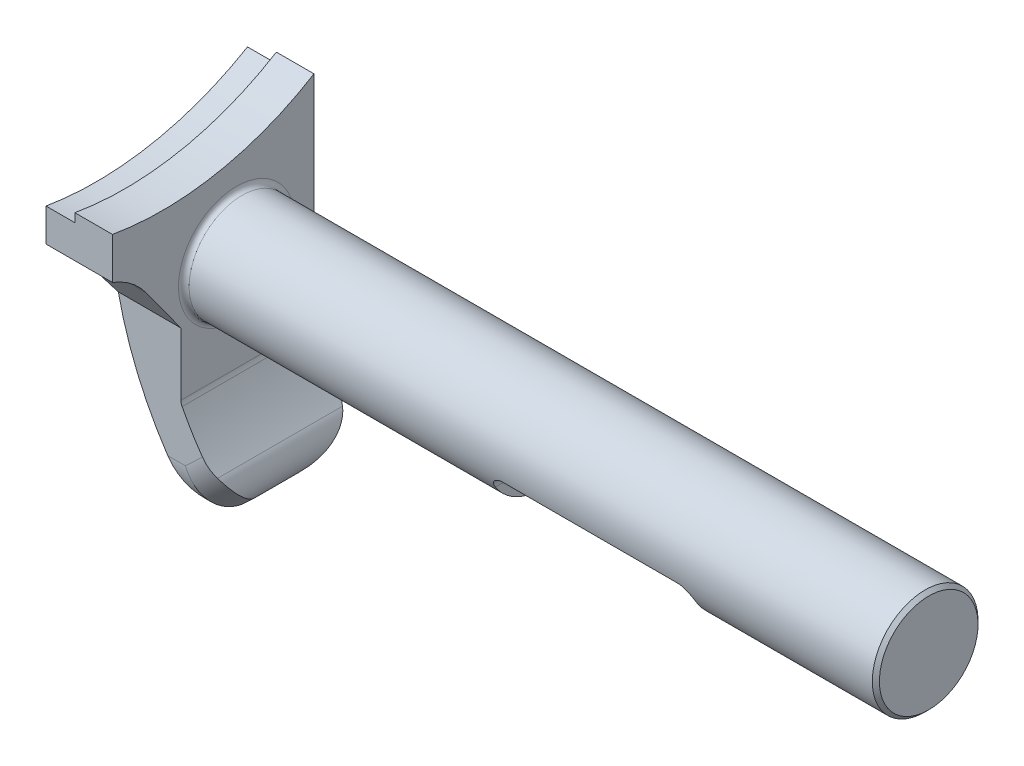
ISO-10303-21;
HEADER;
FILE_DESCRIPTION(('STEP AP214'),'2;1');
FILE_NAME('part.step','',(''),(''),'','','');
FILE_SCHEMA(('AUTOMOTIVE_DESIGN { 1 0 10303 214 1 1 1 1 }'));
ENDSEC;
DATA;
#1=APPLICATION_CONTEXT('core data for automotive mechanical design processes');
#2=APPLICATION_PROTOCOL_DEFINITION('international standard','automotive_design',2000,#1);
#3=PRODUCT_CONTEXT('',#1,'mechanical');
#4=PRODUCT('Part','Part','',(#3));
#5=PRODUCT_RELATED_PRODUCT_CATEGORY('part','',(#4));
#6=PRODUCT_DEFINITION_FORMATION('','',#4);
#7=PRODUCT_DEFINITION_CONTEXT('part definition',#1,'design');
#8=PRODUCT_DEFINITION('design','',#6,#7);
#9=PRODUCT_DEFINITION_SHAPE('','',#8);
#10=(LENGTH_UNIT() NAMED_UNIT(*) SI_UNIT(.MILLI.,.METRE.));
#11=(NAMED_UNIT(*) PLANE_ANGLE_UNIT() SI_UNIT($,.RADIAN.));
#12=(NAMED_UNIT(*) SI_UNIT($,.STERADIAN.) SOLID_ANGLE_UNIT());
#13=UNCERTAINTY_MEASURE_WITH_UNIT(LENGTH_MEASURE(1.E-05),#10,'distance_accuracy_value','');
#14=(GEOMETRIC_REPRESENTATION_CONTEXT(3) GLOBAL_UNCERTAINTY_ASSIGNED_CONTEXT((#13)) GLOBAL_UNIT_ASSIGNED_CONTEXT((#10,
#11,#12)) REPRESENTATION_CONTEXT('',''));
#15=CARTESIAN_POINT('',(0.,0.,0.));
#16=DIRECTION('',(0.,0.,1.));
#17=DIRECTION('',(1.,0.,0.));
#18=AXIS2_PLACEMENT_3D('',#15,#16,#17);
#19=CARTESIAN_POINT('',(15.9689446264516,-0.720330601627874,0.812800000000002));
#20=DIRECTION('',(-0.726548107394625,-0.687115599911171,0.));
#21=DIRECTION('',(0.687115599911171,-0.726548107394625,0.));
#22=AXIS2_PLACEMENT_3D('',#19,#20,#21);
#23=CYLINDRICAL_SURFACE('',#22,3.175);
#24=CARTESIAN_POINT('',(5.08083712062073,-11.0174994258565,0.812800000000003));
#25=DIRECTION('',(-0.929125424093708,-0.369764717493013,0.));
#26=DIRECTION('',(-0.369764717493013,0.929125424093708,0.));
#27=AXIS2_PLACEMENT_3D('',#24,#25,#26);
#28=ELLIPSE('',#27,3.41719203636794,3.175);
#29=CARTESIAN_POINT('',(6.34439416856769,-14.1924994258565,0.812800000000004));
#30=VERTEX_POINT('',#29);
#31=CARTESIAN_POINT('',(5.08083712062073,-11.0174994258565,3.9878));
#32=VERTEX_POINT('',#31);
#33=EDGE_CURVE('E455',#30,#32,#28,.T.);
#34=ORIENTED_EDGE('',*,*,#33,.F.);
#35=DIRECTION('',(0.726548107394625,0.687115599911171,0.));
#36=VECTOR('',#35,1.);
#37=CARTESIAN_POINT('',(18.1505366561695,-3.02712084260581,0.812800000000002));
#38=LINE('',#37,#36);
#39=CARTESIAN_POINT('',(6.89408845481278,-13.6726391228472,0.812800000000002));
#40=VERTEX_POINT('',#39);
#41=EDGE_CURVE('E12',#40,#30,#38,.F.);
#42=ORIENTED_EDGE('',*,*,#41,.F.);
#43=CARTESIAN_POINT('',(7.08959376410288,-10.9331868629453,3.7008595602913));
#44=CARTESIAN_POINT('',(7.12742421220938,-10.9808520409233,3.67318629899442));
#45=CARTESIAN_POINT('',(7.16255801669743,-11.0295296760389,3.64368845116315));
#46=CARTESIAN_POINT('',(7.22751612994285,-11.1282000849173,3.58146991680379));
#47=CARTESIAN_POINT('',(7.25734958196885,-11.1781904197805,3.54875493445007));
#48=CARTESIAN_POINT('',(7.3116393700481,-11.2784257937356,3.48078280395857));
#49=CARTESIAN_POINT('',(7.33614813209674,-11.3286628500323,3.44555545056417));
#50=CARTESIAN_POINT('',(7.38041727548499,-11.4294369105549,3.37260769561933));
#51=CARTESIAN_POINT('',(7.40017501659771,-11.479974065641,3.33488592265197));
#52=CARTESIAN_POINT('',(7.46243896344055,-11.6595013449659,3.19687695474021));
#53=CARTESIAN_POINT('',(7.49253782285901,-11.7882725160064,3.09052191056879));
#54=CARTESIAN_POINT('',(7.52798101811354,-12.0410690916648,2.86773133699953));
#55=CARTESIAN_POINT('',(7.53319262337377,-12.1650655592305,2.75124512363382));
#56=CARTESIAN_POINT('',(7.52425621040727,-12.3688188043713,2.54818478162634));
#57=CARTESIAN_POINT('',(7.51551447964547,-12.4505601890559,2.46328913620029));
#58=CARTESIAN_POINT('',(7.48896980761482,-12.6099023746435,2.2910439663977));
#59=CARTESIAN_POINT('',(7.47116308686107,-12.6875014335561,2.20369343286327));
#60=CARTESIAN_POINT('',(7.40558444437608,-12.9133961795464,1.93904298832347));
#61=CARTESIAN_POINT('',(7.3456383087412,-13.0550263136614,1.75890672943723));
#62=CARTESIAN_POINT('',(7.22192544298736,-13.2767310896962,1.45218872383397));
#63=CARTESIAN_POINT('',(7.16521864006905,-13.3622029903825,1.32647961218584));
#64=CARTESIAN_POINT('',(7.04043989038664,-13.5228751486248,1.07435329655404));
#65=CARTESIAN_POINT('',(6.97238658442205,-13.5980918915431,0.947937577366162));
#66=CARTESIAN_POINT('',(6.89749554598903,-13.6694113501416,0.818666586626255));
#67=CARTESIAN_POINT('',(6.89579338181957,-13.6710267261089,0.815733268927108));
#68=CARTESIAN_POINT('',(6.89408845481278,-13.6726391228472,0.812800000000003));
#69=B_SPLINE_CURVE_WITH_KNOTS('',3,(#43,#44,#45,#46,#47,#48,#49,#50,#51,#52,#53,#54,#55,#56,#57,
#58,#59,#60,#61,#62,#63,#64,#65,#66,#67,#68),.UNSPECIFIED.,.F.,.F.,(4,2,2,2,2,2,2,2,2,2,2,2,4),
(0.,0.200392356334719,0.400435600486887,0.598409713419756,0.796493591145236,1.30263115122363,
1.81146509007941,2.16553187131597,2.5197463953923,3.2271799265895,3.7133370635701,
4.19870323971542,4.20997267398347),.UNSPECIFIED.);
#70=CARTESIAN_POINT('',(7.08959376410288,-10.9331868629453,3.7008595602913));
#71=VERTEX_POINT('',#70);
#72=EDGE_CURVE('E46',#71,#40,#69,.T.);
#73=ORIENTED_EDGE('',*,*,#72,.F.);
#74=CARTESIAN_POINT('',(6.29662382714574,-9.867698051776,3.9878));
#75=CARTESIAN_POINT('',(6.34833857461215,-9.94188949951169,3.98781058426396));
#76=CARTESIAN_POINT('',(6.40053418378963,-10.0157495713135,3.98402127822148));
#77=CARTESIAN_POINT('',(6.50547693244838,-10.1622916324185,3.96887352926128));
#78=CARTESIAN_POINT('',(6.55822407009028,-10.2349736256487,3.95751511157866));
#79=CARTESIAN_POINT('',(6.66239395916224,-10.3766507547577,3.92767968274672));
#80=CARTESIAN_POINT('',(6.71381283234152,-10.4456922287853,3.90940901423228));
#81=CARTESIAN_POINT('',(6.81637954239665,-10.5817252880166,3.86583957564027));
#82=CARTESIAN_POINT('',(6.86752738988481,-10.6487169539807,3.8405410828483));
#83=CARTESIAN_POINT('',(6.96915382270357,-10.7802494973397,3.78305274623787));
#84=CARTESIAN_POINT('',(7.01963215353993,-10.8447894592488,3.75086035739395));
#85=CARTESIAN_POINT('',(7.11947266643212,-10.970995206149,3.67979311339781));
#86=CARTESIAN_POINT('',(7.16883479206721,-11.0326608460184,3.64091792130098));
#87=CARTESIAN_POINT('',(7.26739392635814,-11.1544568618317,3.5555373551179));
#88=CARTESIAN_POINT('',(7.31654603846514,-11.214493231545,3.50884592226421));
#89=CARTESIAN_POINT('',(7.41274498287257,-11.3307730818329,3.40900434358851));
#90=CARTESIAN_POINT('',(7.45979164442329,-11.3870162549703,3.3558536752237));
#91=CARTESIAN_POINT('',(7.50554950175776,-11.441179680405,3.29964854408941));
#92=B_SPLINE_CURVE_WITH_KNOTS('',3,(#74,#75,#76,#77,#78,#79,#80,#81,#82,#83,#84,#85,#86,#87,#88,
#89,#90,#91),.UNSPECIFIED.,.F.,.F.,(4,2,2,2,2,2,2,2,4),(0.,0.271233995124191,0.542467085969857,
0.806171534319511,1.06986557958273,1.33365714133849,1.59746200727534,1.86879383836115,
2.14014763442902),.UNSPECIFIED.);
#93=CARTESIAN_POINT('',(6.29662382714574,-9.867698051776,3.9878));
#94=VERTEX_POINT('',#93);
#95=EDGE_CURVE('E304',#94,#71,#92,.T.);
#96=ORIENTED_EDGE('',*,*,#95,.F.);
#97=DIRECTION('',(0.726548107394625,0.687115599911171,0.));
#98=VECTOR('',#97,1.);
#99=CARTESIAN_POINT('',(15.9689446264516,-0.720330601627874,3.9878));
#100=LINE('',#99,#98);
#101=EDGE_CURVE('E311',#32,#94,#100,.T.);
#102=ORIENTED_EDGE('',*,*,#101,.F.);
#103=EDGE_LOOP('',(#34,#42,#73,#96,#102));
#104=FACE_BOUND('',#103,.T.);
#105=ADVANCED_FACE('F38',(#104),#23,.T.);
#106=CARTESIAN_POINT('',(21.4600745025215,4.47277493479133,-2.3622));
#107=DIRECTION('',(0.726548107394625,0.687115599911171,0.));
#108=DIRECTION('',(-0.687115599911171,0.726548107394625,0.));
#109=AXIS2_PLACEMENT_3D('',#106,#107,#108);
#110=CYLINDRICAL_SURFACE('',#109,3.175);
#111=DIRECTION('',(-0.726548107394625,-0.687115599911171,0.));
#112=VECTOR('',#111,1.);
#113=CARTESIAN_POINT('',(21.4600745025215,4.47277493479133,-5.5372));
#114=LINE('',#113,#112);
#115=CARTESIAN_POINT('',(6.29662382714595,-9.86769805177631,-5.5372));
#116=VERTEX_POINT('',#115);
#117=CARTESIAN_POINT('',(5.08083712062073,-11.0174994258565,-5.5372));
#118=VERTEX_POINT('',#117);
#119=EDGE_CURVE('E416',#116,#118,#114,.T.);
#120=ORIENTED_EDGE('',*,*,#119,.F.);
#121=CARTESIAN_POINT('',(7.08959376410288,-10.9331868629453,-5.2502595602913));
#122=CARTESIAN_POINT('',(7.03824775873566,-10.8684904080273,-5.28785242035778));
#123=CARTESIAN_POINT('',(6.98627826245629,-10.8022243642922,-5.32188655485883));
#124=CARTESIAN_POINT('',(6.88156512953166,-10.6670249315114,-5.38265091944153));
#125=CARTESIAN_POINT('',(6.82882159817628,-10.5980919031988,-5.40938213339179));
#126=CARTESIAN_POINT('',(6.72446781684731,-10.4599306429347,-5.45473483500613));
#127=CARTESIAN_POINT('',(6.67286608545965,-10.3907621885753,-5.47355835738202));
#128=CARTESIAN_POINT('',(6.56977247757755,-10.2507874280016,-5.50403470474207));
#129=CARTESIAN_POINT('',(6.51828059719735,-10.1799811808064,-5.51568778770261));
#130=CARTESIAN_POINT('',(6.41582470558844,-10.0372456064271,-5.53177435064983));
#131=CARTESIAN_POINT('',(6.36486038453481,-9.96531700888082,-5.53621233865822));
#132=CARTESIAN_POINT('',(6.26378480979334,-9.82077642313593,-5.53789315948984));
#133=CARTESIAN_POINT('',(6.21367359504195,-9.74816440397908,-5.53513566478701));
#134=CARTESIAN_POINT('',(6.11324265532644,-9.60070313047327,-5.52230196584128));
#135=CARTESIAN_POINT('',(6.06295687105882,-9.5258485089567,-5.51202164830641));
#136=CARTESIAN_POINT('',(5.96396208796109,-9.37648878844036,-5.48403581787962));
#137=CARTESIAN_POINT('',(5.91525303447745,-9.30198367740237,-5.46633056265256));
#138=CARTESIAN_POINT('',(5.86749137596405,-9.22792470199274,-5.44497416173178));
#139=B_SPLINE_CURVE_WITH_KNOTS('',3,(#121,#122,#123,#124,#125,#126,#127,#128,#129,#130,#131,
#132,#133,#134,#135,#136,#137,#138),.UNSPECIFIED.,.F.,.F.,(4,2,2,2,2,2,2,2,4),(0.,
0.272157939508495,0.544279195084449,0.808948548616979,1.07360837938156,1.33810278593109,
1.60260923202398,1.87457175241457,2.1465248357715),.UNSPECIFIED.);
#140=CARTESIAN_POINT('',(7.08959376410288,-10.9331868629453,-5.2502595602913));
#141=VERTEX_POINT('',#140);
#142=EDGE_CURVE('E296',#141,#116,#139,.T.);
#143=ORIENTED_EDGE('',*,*,#142,.F.);
#144=CARTESIAN_POINT('',(6.89408845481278,-13.6726391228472,-2.3622));
#145=CARTESIAN_POINT('',(6.89579334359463,-13.6710267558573,-2.36513321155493));
#146=CARTESIAN_POINT('',(6.89749550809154,-13.6694113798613,-2.36806652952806));
#147=CARTESIAN_POINT('',(7.02872234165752,-13.5444432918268,-2.59457927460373));
#148=CARTESIAN_POINT('',(7.14237622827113,-13.4036477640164,-2.81873325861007));
#149=CARTESIAN_POINT('',(7.28375568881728,-13.1699280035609,-3.15120800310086));
#150=CARTESIAN_POINT('',(7.32607678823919,-13.0881160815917,-3.26158265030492));
#151=CARTESIAN_POINT('',(7.39989761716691,-12.917368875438,-3.48040227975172));
#152=CARTESIAN_POINT('',(7.4314040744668,-12.8284380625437,-3.58884842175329));
#153=CARTESIAN_POINT('',(7.49106360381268,-12.612007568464,-3.84001883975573));
#154=CARTESIAN_POINT('',(7.51429347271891,-12.4818013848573,-3.98163501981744));
#155=CARTESIAN_POINT('',(7.53432625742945,-12.2112097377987,-4.25677066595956));
#156=CARTESIAN_POINT('',(7.5311738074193,-12.070841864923,-4.39030342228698));
#157=CARTESIAN_POINT('',(7.49771181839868,-11.8205113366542,-4.61190213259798));
#158=CARTESIAN_POINT('',(7.47464636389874,-11.7120881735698,-4.70278735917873));
#159=CARTESIAN_POINT('',(7.40807651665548,-11.494137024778,-4.87492440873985));
#160=CARTESIAN_POINT('',(7.36464948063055,-11.3846147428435,-4.95621124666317));
#161=CARTESIAN_POINT('',(7.28817739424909,-11.2339458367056,-5.06062295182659));
#162=CARTESIAN_POINT('',(7.26475828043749,-11.1915375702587,-5.08917168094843));
#163=CARTESIAN_POINT('',(7.21424780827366,-11.1075002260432,-5.14407294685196));
#164=CARTESIAN_POINT('',(7.18715792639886,-11.0658708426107,-5.17042635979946));
#165=CARTESIAN_POINT('',(7.12899182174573,-10.9834341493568,-5.22091996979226));
#166=CARTESIAN_POINT('',(7.09788496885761,-10.9426362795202,-5.24504042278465));
#167=CARTESIAN_POINT('',(7.03182955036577,-10.8626170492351,-5.29064550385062));
#168=CARTESIAN_POINT('',(6.99687635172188,-10.8233976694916,-5.31212688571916));
#169=CARTESIAN_POINT('',(6.96002303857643,-10.7852188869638,-5.3321696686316));
#170=B_SPLINE_CURVE_WITH_KNOTS('',3,(#144,#145,#146,#147,#148,#149,#150,#151,#152,#153,#154,
#155,#156,#157,#158,#159,#160,#161,#162,#163,#164,#165,#166,#167,#168,#169),.UNSPECIFIED.,.F.,
.F.,(4,2,2,2,2,2,2,2,2,2,2,2,4),(0.,0.0112694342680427,0.870203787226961,1.30106945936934,
1.73166660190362,2.31109802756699,2.8895493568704,3.31820331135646,3.74524177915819,
3.91380394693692,4.08229851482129,4.2521635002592,4.42223538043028),.UNSPECIFIED.);
#171=CARTESIAN_POINT('',(6.89408845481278,-13.6726391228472,-2.3622));
#172=VERTEX_POINT('',#171);
#173=EDGE_CURVE('E422',#172,#141,#170,.T.);
#174=ORIENTED_EDGE('',*,*,#173,.F.);
#175=DIRECTION('',(-0.726548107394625,-0.687115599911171,0.));
#176=VECTOR('',#175,1.);
#177=CARTESIAN_POINT('',(23.6416665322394,2.1659846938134,-2.3622));
#178=LINE('',#177,#176);
#179=CARTESIAN_POINT('',(6.34439416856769,-14.1924994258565,-2.36219999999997));
#180=VERTEX_POINT('',#179);
#181=EDGE_CURVE('E327',#180,#172,#178,.F.);
#182=ORIENTED_EDGE('',*,*,#181,.F.);
#183=CARTESIAN_POINT('',(5.08083712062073,-11.0174994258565,-2.3622));
#184=DIRECTION('',(-0.929125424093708,-0.369764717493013,0.));
#185=DIRECTION('',(-0.369764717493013,0.929125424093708,0.));
#186=AXIS2_PLACEMENT_3D('',#183,#184,#185);
#187=ELLIPSE('',#186,3.41719203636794,3.175);
#188=EDGE_CURVE('E419',#118,#180,#187,.T.);
#189=ORIENTED_EDGE('',*,*,#188,.F.);
#190=EDGE_LOOP('',(#120,#143,#174,#182,#189));
#191=FACE_BOUND('',#190,.T.);
#192=ADVANCED_FACE('F427',(#191),#110,.T.);
#193=CARTESIAN_POINT('',(0.,0.,8.89));
#194=DIRECTION('',(1.,0.,0.));
#195=DIRECTION('',(0.,0.,-1.));
#196=AXIS2_PLACEMENT_3D('',#193,#194,#195);
#197=PLANE('',#196);
#198=DIRECTION('',(0.,-1.,0.));
#199=VECTOR('',#198,1.);
#200=CARTESIAN_POINT('',(0.,0.,8.89));
#201=LINE('',#200,#199);
#202=CARTESIAN_POINT('',(0.,5.00100006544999,8.88999999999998));
#203=VERTEX_POINT('',#202);
#204=CARTESIAN_POINT('',(0.,2.64161071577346,8.89));
#205=VERTEX_POINT('',#204);
#206=EDGE_CURVE('E464',#203,#205,#201,.T.);
#207=ORIENTED_EDGE('',*,*,#206,.F.);
#208=CARTESIAN_POINT('',(0.,26.0858,5.3086));
#209=DIRECTION('',(-1.,0.,0.));
#210=DIRECTION('',(0.,0.,1.));
#211=AXIS2_PLACEMENT_3D('',#208,#209,#210);
#212=CIRCLE('',#211,21.3868);
#213=CARTESIAN_POINT('',(0.,7.65311607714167,-5.5372));
#214=VERTEX_POINT('',#213);
#215=EDGE_CURVE('E188',#214,#203,#212,.T.);
#216=ORIENTED_EDGE('',*,*,#215,.F.);
#217=DIRECTION('',(0.,-1.,0.));
#218=VECTOR('',#217,1.);
#219=CARTESIAN_POINT('',(0.,8.36404325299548,-5.5372));
#220=LINE('',#219,#218);
#221=CARTESIAN_POINT('',(0.,-1.10432267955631,-5.5372));
#222=VERTEX_POINT('',#221);
#223=EDGE_CURVE('E193',#214,#222,#220,.T.);
#224=ORIENTED_EDGE('',*,*,#223,.T.);
#225=DIRECTION('',(0.,0.,-1.));
#226=VECTOR('',#225,1.);
#227=CARTESIAN_POINT('',(0.,-1.10432267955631,8.89));
#228=LINE('',#227,#226);
#229=CARTESIAN_POINT('',(0.,-1.10432267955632,5.10013441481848));
#230=VERTEX_POINT('',#229);
#231=EDGE_CURVE('E330',#230,#222,#228,.T.);
#232=ORIENTED_EDGE('',*,*,#231,.F.);
#233=DIRECTION('',(0.,0.809016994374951,0.587785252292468));
#234=VECTOR('',#233,1.);
#235=CARTESIAN_POINT('',(0.,-2.63531965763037,3.9878));
#236=LINE('',#235,#234);
#237=CARTESIAN_POINT('',(0.,0.825397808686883,6.50215841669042));
#238=VERTEX_POINT('',#237);
#239=EDGE_CURVE('E198',#230,#238,#236,.T.);
#240=ORIENTED_EDGE('',*,*,#239,.T.);
#241=CARTESIAN_POINT('',(0.,-2.2352,10.7147099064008));
#242=DIRECTION('',(1.,0.,0.));
#243=DIRECTION('',(0.,0.,-1.));
#244=AXIS2_PLACEMENT_3D('',#241,#242,#243);
#245=CIRCLE('',#244,5.207);
#246=EDGE_CURVE('E201',#238,#205,#245,.T.);
#247=ORIENTED_EDGE('',*,*,#246,.T.);
#248=EDGE_LOOP('',(#207,#216,#224,#232,#240,#247));
#249=FACE_BOUND('',#248,.T.);
#250=ADVANCED_FACE('F431',(#249),#197,.F.);
#251=CARTESIAN_POINT('',(23.876,2.3876,8.89));
#252=DIRECTION('',(0.,0.,-1.));
#253=DIRECTION('',(-1.,0.,0.));
#254=AXIS2_PLACEMENT_3D('',#251,#252,#253);
#255=CYLINDRICAL_SURFACE('',#254,24.13);
#256=CARTESIAN_POINT('',(23.876,2.3876,7.63716474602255));
#257=DIRECTION('',(0.,-0.587785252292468,0.809016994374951));
#258=DIRECTION('',(0.,-0.809016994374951,-0.587785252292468));
#259=AXIS2_PLACEMENT_3D('',#256,#257,#258);
#260=ELLIPSE('',#259,29.8263202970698,24.13);
#261=CARTESIAN_POINT('',(0.274576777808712,-2.63531965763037,3.9878));
#262=VERTEX_POINT('',#261);
#263=EDGE_CURVE('E237',#230,#262,#260,.T.);
#264=ORIENTED_EDGE('',*,*,#263,.F.);
#265=ORIENTED_EDGE('',*,*,#231,.T.);
#266=CARTESIAN_POINT('',(23.876,2.3876,-5.5372));
#267=DIRECTION('',(0.,0.,-1.));
#268=DIRECTION('',(0.,1.,0.));
#269=AXIS2_PLACEMENT_3D('',#266,#267,#268);
#270=CIRCLE('',#269,24.13);
#271=CARTESIAN_POINT('',(3.8120968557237,-11.0174994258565,-5.5372));
#272=VERTEX_POINT('',#271);
#273=EDGE_CURVE('E226',#272,#222,#270,.T.);
#274=ORIENTED_EDGE('',*,*,#273,.F.);
#275=CARTESIAN_POINT('',(6.3443941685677,-14.1924994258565,-2.36219999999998));
#276=CARTESIAN_POINT('',(6.34441563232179,-14.1925176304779,-2.4355954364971));
#277=CARTESIAN_POINT('',(6.34198801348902,-14.1899550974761,-2.50897534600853));
#278=CARTESIAN_POINT('',(6.33239943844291,-14.1798097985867,-2.65501448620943));
#279=CARTESIAN_POINT('',(6.32524255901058,-14.1722313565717,-2.72767428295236));
#280=CARTESIAN_POINT('',(6.30644297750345,-14.1522833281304,-2.87107740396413));
#281=CARTESIAN_POINT('',(6.29484036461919,-14.1399565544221,-2.94183197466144));
#282=CARTESIAN_POINT('',(6.26743762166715,-14.110758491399,-3.08155693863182));
#283=CARTESIAN_POINT('',(6.25163680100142,-14.0938864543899,-3.15052703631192));
#284=CARTESIAN_POINT('',(6.19855082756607,-14.0369967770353,-3.35363141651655));
#285=CARTESIAN_POINT('',(6.15549958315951,-13.9906190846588,-3.48455685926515));
#286=CARTESIAN_POINT('',(6.05700529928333,-13.8834058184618,-3.7354944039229));
#287=CARTESIAN_POINT('',(6.00153204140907,-13.8225349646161,-3.85547887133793));
#288=CARTESIAN_POINT('',(5.85636867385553,-13.6612566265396,-4.13022300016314));
#289=CARTESIAN_POINT('',(5.76198512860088,-13.5548811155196,-4.27901246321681));
#290=CARTESIAN_POINT('',(5.5610065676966,-13.3235909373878,-4.55187846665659));
#291=CARTESIAN_POINT('',(5.45438845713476,-13.198641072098,-4.67590701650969));
#292=CARTESIAN_POINT('',(5.20630364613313,-12.9011368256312,-4.92721473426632));
#293=CARTESIAN_POINT('',(5.06277367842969,-12.724478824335,-5.04760186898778));
#294=CARTESIAN_POINT('',(4.7711228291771,-12.3540483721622,-5.24989737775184));
#295=CARTESIAN_POINT('',(4.62300258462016,-12.1602782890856,-5.3318110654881));
#296=CARTESIAN_POINT('',(4.36298904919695,-11.8086997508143,-5.44112725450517));
#297=CARTESIAN_POINT('',(4.25100296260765,-11.6535359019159,-5.47692410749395));
#298=CARTESIAN_POINT('',(4.08476909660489,-11.4172307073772,-5.51294179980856));
#299=CARTESIAN_POINT('',(4.02970120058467,-11.3379476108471,-5.52200118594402));
#300=CARTESIAN_POINT('',(3.92029614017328,-11.1783929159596,-5.53412924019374));
#301=CARTESIAN_POINT('',(3.86595918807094,-11.0981210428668,-5.5371962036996));
#302=CARTESIAN_POINT('',(3.8120968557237,-11.0174994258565,-5.5372));
#303=B_SPLINE_CURVE_WITH_KNOTS('',3,(#275,#276,#277,#278,#279,#280,#281,#282,#283,#284,#285,
#286,#287,#288,#289,#290,#291,#292,#293,#294,#295,#296,#297,#298,#299,#300,#301,#302),
.UNSPECIFIED.,.F.,.F.,(4,2,2,2,2,2,2,2,2,2,2,2,2,4),(0.,0.220076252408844,0.439963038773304,
0.657911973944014,0.875896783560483,1.31006387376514,1.74529884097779,2.35938065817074,
2.97464134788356,3.74322326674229,4.51169900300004,5.09421199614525,5.38490570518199,
5.67568209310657),.UNSPECIFIED.);
#304=EDGE_CURVE('E239',#180,#272,#303,.T.);
#305=ORIENTED_EDGE('',*,*,#304,.F.);
#306=DIRECTION('',(0.,0.,-1.));
#307=VECTOR('',#306,1.);
#308=CARTESIAN_POINT('',(6.34439416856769,-14.1924994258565,8.89));
#309=LINE('',#308,#307);
#310=EDGE_CURVE('E328',#30,#180,#309,.T.);
#311=ORIENTED_EDGE('',*,*,#310,.F.);
#312=CARTESIAN_POINT('',(3.8120968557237,-11.0174994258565,3.9878));
#313=CARTESIAN_POINT('',(3.88689999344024,-11.1294796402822,3.98779026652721));
#314=CARTESIAN_POINT('',(3.96264056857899,-11.2407948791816,3.98187630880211));
#315=CARTESIAN_POINT('',(4.11537987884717,-11.4613220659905,3.95858342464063));
#316=CARTESIAN_POINT('',(4.19237841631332,-11.5705343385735,3.94120628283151));
#317=CARTESIAN_POINT('',(4.34744935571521,-11.7866873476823,3.89520904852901));
#318=CARTESIAN_POINT('',(4.42552528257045,-11.8936130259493,3.8665300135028));
#319=CARTESIAN_POINT('',(4.5816637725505,-12.1038688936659,3.79820570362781));
#320=CARTESIAN_POINT('',(4.65972633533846,-12.2071990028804,3.75856018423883));
#321=CARTESIAN_POINT('',(4.88921816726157,-12.5060504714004,3.62556663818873));
#322=CARTESIAN_POINT('',(5.03977768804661,-12.6957360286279,3.51701500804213));
#323=CARTESIAN_POINT('',(5.33153939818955,-13.0530241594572,3.25935940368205));
#324=CARTESIAN_POINT('',(5.47276325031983,-13.2206788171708,3.11035372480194));
#325=CARTESIAN_POINT('',(5.69473346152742,-13.4780103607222,2.8254410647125));
#326=CARTESIAN_POINT('',(5.78042650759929,-13.575526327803,2.70044797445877));
#327=CARTESIAN_POINT('',(5.93905174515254,-13.7535565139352,2.43159964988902));
#328=CARTESIAN_POINT('',(6.01200208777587,-13.8340949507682,2.28777176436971));
#329=CARTESIAN_POINT('',(6.12762015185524,-13.9604219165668,2.01205436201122));
#330=CARTESIAN_POINT('',(6.17341329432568,-14.0099141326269,1.8831824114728));
#331=CARTESIAN_POINT('',(6.25012228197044,-14.092343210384,1.61615044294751));
#332=CARTESIAN_POINT('',(6.2810708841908,-14.1253165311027,1.47801164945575));
#333=CARTESIAN_POINT('',(6.31681080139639,-14.163296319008,1.25118147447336));
#334=CARTESIAN_POINT('',(6.32709865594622,-14.1741973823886,1.1642898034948));
#335=CARTESIAN_POINT('',(6.34091347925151,-14.1888191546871,0.989223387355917));
#336=CARTESIAN_POINT('',(6.34442859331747,-14.1925272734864,0.901046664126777));
#337=CARTESIAN_POINT('',(6.3443941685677,-14.1924994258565,0.812800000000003));
#338=B_SPLINE_CURVE_WITH_KNOTS('',3,(#312,#313,#314,#315,#316,#317,#318,#319,#320,#321,#322,
#323,#324,#325,#326,#327,#328,#329,#330,#331,#332,#333,#334,#335,#336,#337),.UNSPECIFIED.,.F.,
.F.,(4,2,2,2,2,2,2,2,2,2,2,2,4),(0.,0.40381738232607,0.807571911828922,1.21346060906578,
1.61935835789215,2.41148969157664,3.20171326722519,3.74053714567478,4.27858713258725,
4.71323635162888,5.14692197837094,5.410926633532,5.67539297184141),.UNSPECIFIED.);
#339=CARTESIAN_POINT('',(3.8120968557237,-11.0174994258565,3.9878));
#340=VERTEX_POINT('',#339);
#341=EDGE_CURVE('E248',#340,#30,#338,.T.);
#342=ORIENTED_EDGE('',*,*,#341,.F.);
#343=CARTESIAN_POINT('',(23.876,2.3876,3.9878));
#344=DIRECTION('',(0.,0.,1.));
#345=DIRECTION('',(0.,-1.,0.));
#346=AXIS2_PLACEMENT_3D('',#343,#344,#345);
#347=CIRCLE('',#346,24.13);
#348=EDGE_CURVE('E234',#262,#340,#347,.T.);
#349=ORIENTED_EDGE('',*,*,#348,.F.);
#350=EDGE_LOOP('',(#264,#265,#274,#305,#311,#342,#349));
#351=FACE_BOUND('',#350,.T.);
#352=ADVANCED_FACE('F255',(#351),#255,.T.);
#353=CARTESIAN_POINT('',(10.0805807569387,-10.6590897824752,8.89));
#354=DIRECTION('',(-0.687115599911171,0.726548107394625,0.));
#355=DIRECTION('',(-0.726548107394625,-0.687115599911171,0.));
#356=AXIS2_PLACEMENT_3D('',#353,#354,#355);
#357=PLANE('',#356);
#358=DIRECTION('',(0.,0.,-1.));
#359=VECTOR('',#358,1.);
#360=CARTESIAN_POINT('',(6.89408845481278,-13.6726391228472,8.89));
#361=LINE('',#360,#359);
#362=EDGE_CURVE('E320',#40,#172,#361,.T.);
#363=ORIENTED_EDGE('',*,*,#362,.F.);
#364=ORIENTED_EDGE('',*,*,#41,.T.);
#365=ORIENTED_EDGE('',*,*,#310,.T.);
#366=ORIENTED_EDGE('',*,*,#181,.T.);
#367=EDGE_LOOP('',(#363,#364,#365,#366));
#368=FACE_BOUND('',#367,.T.);
#369=ADVANCED_FACE('F325',(#368),#357,.F.);
#370=CARTESIAN_POINT('',(5.49786955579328,-12.1962933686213,8.89));
#371=DIRECTION('',(0.,0.,-1.));
#372=DIRECTION('',(-1.,0.,0.));
#373=AXIS2_PLACEMENT_3D('',#370,#371,#372);
#374=CYLINDRICAL_SURFACE('',#373,2.032);
#375=DIRECTION('',(0.,0.,-1.));
#376=VECTOR('',#375,1.);
#377=CARTESIAN_POINT('',(7.08959376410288,-10.9331868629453,8.89));
#378=LINE('',#377,#376);
#379=EDGE_CURVE('E322',#71,#141,#378,.T.);
#380=ORIENTED_EDGE('',*,*,#379,.F.);
#381=ORIENTED_EDGE('',*,*,#72,.T.);
#382=ORIENTED_EDGE('',*,*,#362,.T.);
#383=ORIENTED_EDGE('',*,*,#173,.T.);
#384=EDGE_LOOP('',(#380,#381,#382,#383));
#385=FACE_BOUND('',#384,.T.);
#386=ADVANCED_FACE('F291',(#385),#374,.T.);
#387=CARTESIAN_POINT('',(23.876,2.3876,8.89));
#388=DIRECTION('',(0.,0.,-1.));
#389=DIRECTION('',(-1.,0.,0.));
#390=AXIS2_PLACEMENT_3D('',#387,#388,#389);
#391=CYLINDRICAL_SURFACE('',#390,21.4295776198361);
#392=CARTESIAN_POINT('',(23.876,2.3876,3.9878));
#393=DIRECTION('',(0.,0.,1.));
#394=DIRECTION('',(0.,-1.,0.));
#395=AXIS2_PLACEMENT_3D('',#392,#393,#394);
#396=CIRCLE('',#395,21.4295776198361);
#397=CARTESIAN_POINT('',(4.8442536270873,-7.46224400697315,3.9878));
#398=VERTEX_POINT('',#397);
#399=EDGE_CURVE('E231',#398,#94,#396,.T.);
#400=ORIENTED_EDGE('',*,*,#399,.T.);
#401=ORIENTED_EDGE('',*,*,#95,.T.);
#402=ORIENTED_EDGE('',*,*,#379,.T.);
#403=ORIENTED_EDGE('',*,*,#142,.T.);
#404=CARTESIAN_POINT('',(23.876,2.3876,-5.5372));
#405=DIRECTION('',(0.,0.,-1.));
#406=DIRECTION('',(0.,1.,0.));
#407=AXIS2_PLACEMENT_3D('',#404,#405,#406);
#408=CIRCLE('',#407,21.4295776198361);
#409=CARTESIAN_POINT('',(4.8442536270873,-7.46224400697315,-5.5372));
#410=VERTEX_POINT('',#409);
#411=EDGE_CURVE('E224',#116,#410,#408,.T.);
#412=ORIENTED_EDGE('',*,*,#411,.T.);
#413=DIRECTION('',(0.,0.,-1.));
#414=VECTOR('',#413,1.);
#415=CARTESIAN_POINT('',(4.8442536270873,-7.46224400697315,8.89));
#416=LINE('',#415,#414);
#417=EDGE_CURVE('E332',#398,#410,#416,.T.);
#418=ORIENTED_EDGE('',*,*,#417,.F.);
#419=EDGE_LOOP('',(#400,#401,#402,#403,#412,#418));
#420=FACE_BOUND('',#419,.T.);
#421=ADVANCED_FACE('F286',(#420),#391,.F.);
#422=CARTESIAN_POINT('',(5.52099075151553,-7.112,8.89));
#423=DIRECTION('',(0.,0.,-1.));
#424=DIRECTION('',(-1.,0.,0.));
#425=AXIS2_PLACEMENT_3D('',#422,#423,#424);
#426=CYLINDRICAL_SURFACE('',#425,0.761999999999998);
#427=DIRECTION('',(0.,0.,-1.));
#428=VECTOR('',#427,1.);
#429=CARTESIAN_POINT('',(4.75899075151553,-7.112,8.89));
#430=LINE('',#429,#428);
#431=CARTESIAN_POINT('',(4.75899075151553,-7.112,3.9878));
#432=VERTEX_POINT('',#431);
#433=CARTESIAN_POINT('',(4.75899075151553,-7.112,-5.5372));
#434=VERTEX_POINT('',#433);
#435=EDGE_CURVE('E492',#432,#434,#430,.T.);
#436=ORIENTED_EDGE('',*,*,#435,.F.);
#437=CARTESIAN_POINT('',(5.52099075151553,-7.112,3.9878));
#438=DIRECTION('',(0.,0.,1.));
#439=DIRECTION('',(0.,-1.,0.));
#440=AXIS2_PLACEMENT_3D('',#437,#438,#439);
#441=CIRCLE('',#440,0.761999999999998);
#442=EDGE_CURVE('E228',#432,#398,#441,.T.);
#443=ORIENTED_EDGE('',*,*,#442,.T.);
#444=ORIENTED_EDGE('',*,*,#417,.T.);
#445=CARTESIAN_POINT('',(5.52099075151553,-7.112,-5.5372));
#446=DIRECTION('',(0.,0.,-1.));
#447=DIRECTION('',(0.,1.,0.));
#448=AXIS2_PLACEMENT_3D('',#445,#446,#447);
#449=CIRCLE('',#448,0.761999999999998);
#450=EDGE_CURVE('E221',#410,#434,#449,.T.);
#451=ORIENTED_EDGE('',*,*,#450,.T.);
#452=EDGE_LOOP('',(#436,#443,#444,#451));
#453=FACE_BOUND('',#452,.T.);
#454=ADVANCED_FACE('F282',(#453),#426,.F.);
#455=CARTESIAN_POINT('',(4.75899075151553,0.,8.89));
#456=DIRECTION('',(1.,0.,0.));
#457=DIRECTION('',(0.,0.,-1.));
#458=AXIS2_PLACEMENT_3D('',#455,#456,#457);
#459=PLANE('',#458);
#460=CARTESIAN_POINT('',(4.75899075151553,0.,0.));
#461=DIRECTION('',(1.,0.,0.));
#462=DIRECTION('',(0.,0.,-1.));
#463=AXIS2_PLACEMENT_3D('',#460,#461,#462);
#464=CIRCLE('',#463,4.1656);
#465=CARTESIAN_POINT('',(4.75899075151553,0.,-4.1656));
#466=VERTEX_POINT('',#465);
#467=EDGE_CURVE('E410',#466,#466,#464,.F.);
#468=ORIENTED_EDGE('',*,*,#467,.T.);
#469=EDGE_LOOP('',(#468));
#470=FACE_BOUND('',#469,.T.);
#471=DIRECTION('',(0.,-1.,0.));
#472=VECTOR('',#471,1.);
#473=CARTESIAN_POINT('',(4.75899075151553,0.,8.89));
#474=LINE('',#473,#472);
#475=CARTESIAN_POINT('',(4.75899075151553,5.61959336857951,8.89));
#476=VERTEX_POINT('',#475);
#477=CARTESIAN_POINT('',(4.75899075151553,2.64161071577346,8.89));
#478=VERTEX_POINT('',#477);
#479=EDGE_CURVE('E488',#476,#478,#474,.T.);
#480=ORIENTED_EDGE('',*,*,#479,.T.);
#481=CARTESIAN_POINT('',(4.75899075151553,-2.2352,10.7147099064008));
#482=DIRECTION('',(1.,0.,0.));
#483=DIRECTION('',(0.,0.,-1.));
#484=AXIS2_PLACEMENT_3D('',#481,#482,#483);
#485=CIRCLE('',#484,5.207);
#486=CARTESIAN_POINT('',(4.75899075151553,0.825397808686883,6.50215841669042));
#487=VERTEX_POINT('',#486);
#488=EDGE_CURVE('E207',#478,#487,#485,.F.);
#489=ORIENTED_EDGE('',*,*,#488,.T.);
#490=DIRECTION('',(0.,-0.809016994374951,-0.587785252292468));
#491=VECTOR('',#490,1.);
#492=CARTESIAN_POINT('',(4.75899075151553,1.42065407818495,6.93463741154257));
#493=LINE('',#492,#491);
#494=CARTESIAN_POINT('',(4.75899075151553,-2.63531965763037,3.9878));
#495=VERTEX_POINT('',#494);
#496=EDGE_CURVE('E407',#487,#495,#493,.T.);
#497=ORIENTED_EDGE('',*,*,#496,.T.);
#498=DIRECTION('',(0.,-1.,0.));
#499=VECTOR('',#498,1.);
#500=CARTESIAN_POINT('',(4.75899075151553,0.,3.9878));
#501=LINE('',#500,#499);
#502=EDGE_CURVE('E404',#495,#432,#501,.T.);
#503=ORIENTED_EDGE('',*,*,#502,.T.);
#504=ORIENTED_EDGE('',*,*,#435,.T.);
#505=DIRECTION('',(0.,1.,0.));
#506=VECTOR('',#505,1.);
#507=CARTESIAN_POINT('',(4.75899075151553,0.,-5.5372));
#508=LINE('',#507,#506);
#509=CARTESIAN_POINT('',(4.75899075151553,8.36404325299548,-5.5372));
#510=VERTEX_POINT('',#509);
#511=EDGE_CURVE('E401',#434,#510,#508,.T.);
#512=ORIENTED_EDGE('',*,*,#511,.T.);
#513=CARTESIAN_POINT('',(4.75899075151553,26.0858,5.3086));
#514=DIRECTION('',(1.,0.,0.));
#515=DIRECTION('',(0.,0.,-1.));
#516=AXIS2_PLACEMENT_3D('',#513,#514,#515);
#517=CIRCLE('',#516,20.7772);
#518=EDGE_CURVE('E218',#510,#476,#517,.F.);
#519=ORIENTED_EDGE('',*,*,#518,.T.);
#520=EDGE_LOOP('',(#480,#489,#497,#503,#504,#512,#519));
#521=FACE_BOUND('',#520,.T.);
#522=ADVANCED_FACE('F278',(#470,#521),#459,.T.);
#523=CARTESIAN_POINT('',(0.,0.,8.89));
#524=DIRECTION('',(0.,0.,1.));
#525=DIRECTION('',(1.,0.,0.));
#526=AXIS2_PLACEMENT_3D('',#523,#524,#525);
#527=PLANE('',#526);
#528=DIRECTION('',(0.,1.,0.));
#529=VECTOR('',#528,1.);
#530=CARTESIAN_POINT('',(2.06659075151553,5.00100006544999,8.89));
#531=LINE('',#530,#529);
#532=CARTESIAN_POINT('',(2.06659075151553,5.00100006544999,8.88999999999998));
#533=VERTEX_POINT('',#532);
#534=CARTESIAN_POINT('',(2.06659075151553,5.61959336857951,8.89));
#535=VERTEX_POINT('',#534);
#536=EDGE_CURVE('E53',#533,#535,#531,.T.);
#537=ORIENTED_EDGE('',*,*,#536,.F.);
#538=DIRECTION('',(-1.,0.,0.));
#539=VECTOR('',#538,1.);
#540=CARTESIAN_POINT('',(19.6444414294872,5.00100006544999,8.88999999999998));
#541=LINE('',#540,#539);
#542=EDGE_CURVE('E179',#533,#203,#541,.T.);
#543=ORIENTED_EDGE('',*,*,#542,.T.);
#544=ORIENTED_EDGE('',*,*,#206,.T.);
#545=DIRECTION('',(-1.,0.,0.));
#546=VECTOR('',#545,1.);
#547=CARTESIAN_POINT('',(17.78,2.64161071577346,8.89));
#548=LINE('',#547,#546);
#549=EDGE_CURVE('E393',#205,#478,#548,.F.);
#550=ORIENTED_EDGE('',*,*,#549,.T.);
#551=ORIENTED_EDGE('',*,*,#479,.F.);
#552=DIRECTION('',(-1.,0.,0.));
#553=VECTOR('',#552,1.);
#554=CARTESIAN_POINT('',(17.78,5.61959336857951,8.89));
#555=LINE('',#554,#553);
#556=EDGE_CURVE('E398',#476,#535,#555,.T.);
#557=ORIENTED_EDGE('',*,*,#556,.T.);
#558=EDGE_LOOP('',(#537,#543,#544,#550,#551,#557));
#559=FACE_BOUND('',#558,.T.);
#560=ADVANCED_FACE('F274',(#559),#527,.T.);
#561=CARTESIAN_POINT('',(54.3052,0.,0.));
#562=DIRECTION('',(-1.,0.,0.));
#563=DIRECTION('',(0.,-1.,0.));
#564=AXIS2_PLACEMENT_3D('',#561,#562,#563);
#565=PLANE('',#564);
#566=CARTESIAN_POINT('',(54.3052,0.,0.));
#567=DIRECTION('',(-1.,0.,0.));
#568=DIRECTION('',(0.,-1.,0.));
#569=AXIS2_PLACEMENT_3D('',#566,#567,#568);
#570=CIRCLE('',#569,3.5306);
#571=CARTESIAN_POINT('',(54.3052,-3.5306,0.));
#572=VERTEX_POINT('',#571);
#573=EDGE_CURVE('E353',#572,#572,#570,.T.);
#574=ORIENTED_EDGE('',*,*,#573,.F.);
#575=EDGE_LOOP('',(#574));
#576=FACE_BOUND('',#575,.T.);
#577=ADVANCED_FACE('F277',(#576),#565,.F.);
#578=CARTESIAN_POINT('',(54.3052,0.,0.));
#579=DIRECTION('',(-1.,0.,0.));
#580=DIRECTION('',(0.,-1.,0.));
#581=AXIS2_PLACEMENT_3D('',#578,#579,#580);
#582=CONICAL_SURFACE('',#581,3.5306,0.785398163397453);
#583=CARTESIAN_POINT('',(54.0512,0.,0.));
#584=DIRECTION('',(-1.,0.,0.));
#585=DIRECTION('',(0.,-1.,0.));
#586=AXIS2_PLACEMENT_3D('',#583,#584,#585);
#587=CIRCLE('',#586,3.7846);
#588=CARTESIAN_POINT('',(54.0512,-3.7846,0.));
#589=VERTEX_POINT('',#588);
#590=EDGE_CURVE('E342',#589,#589,#587,.T.);
#591=ORIENTED_EDGE('',*,*,#590,.F.);
#592=EDGE_LOOP('',(#591));
#593=FACE_BOUND('',#592,.T.);
#594=ORIENTED_EDGE('',*,*,#573,.T.);
#595=EDGE_LOOP('',(#594));
#596=FACE_BOUND('',#595,.T.);
#597=ADVANCED_FACE('F438',(#593,#596),#582,.T.);
#598=CARTESIAN_POINT('',(4.75899075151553,0.,0.));
#599=DIRECTION('',(-1.,0.,0.));
#600=DIRECTION('',(0.,-1.,0.));
#601=AXIS2_PLACEMENT_3D('',#598,#599,#600);
#602=CYLINDRICAL_SURFACE('',#601,3.7846);
#603=CARTESIAN_POINT('',(5.13999075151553,0.,0.));
#604=DIRECTION('',(1.,0.,0.));
#605=DIRECTION('',(0.,0.,-1.));
#606=AXIS2_PLACEMENT_3D('',#603,#604,#605);
#607=CIRCLE('',#606,3.7846);
#608=CARTESIAN_POINT('',(5.13999075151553,0.,-3.7846));
#609=VERTEX_POINT('',#608);
#610=EDGE_CURVE('E413',#609,#609,#607,.T.);
#611=ORIENTED_EDGE('',*,*,#610,.T.);
#612=EDGE_LOOP('',(#611));
#613=FACE_BOUND('',#612,.T.);
#614=CARTESIAN_POINT('',(39.9379907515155,-1.016,3.64567430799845));
#615=CARTESIAN_POINT('',(39.9655656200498,-1.01599972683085,3.64567257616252));
#616=CARTESIAN_POINT('',(39.9931272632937,-1.01712337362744,3.64536144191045));
#617=CARTESIAN_POINT('',(40.048052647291,-1.02160294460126,3.64410929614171));
#618=CARTESIAN_POINT('',(40.0754163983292,-1.02495875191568,3.64316831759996));
#619=CARTESIAN_POINT('',(40.1568523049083,-1.03833389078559,3.63938886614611));
#620=CARTESIAN_POINT('',(40.2103776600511,-1.05166107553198,3.63559395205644));
#621=CARTESIAN_POINT('',(40.3143389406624,-1.08667883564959,3.62528003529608));
#622=CARTESIAN_POINT('',(40.3647733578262,-1.10837345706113,3.61875971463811));
#623=CARTESIAN_POINT('',(40.4611409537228,-1.15933824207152,3.60275482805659));
#624=CARTESIAN_POINT('',(40.5070746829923,-1.18860747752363,3.59327062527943));
#625=CARTESIAN_POINT('',(40.5933407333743,-1.25373114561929,3.57106958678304));
#626=CARTESIAN_POINT('',(40.6336559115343,-1.28960498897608,3.55834317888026));
#627=CARTESIAN_POINT('',(40.7075591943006,-1.36651913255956,3.52951921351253));
#628=CARTESIAN_POINT('',(40.7411487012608,-1.40755835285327,3.51342236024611));
#629=CARTESIAN_POINT('',(40.8017459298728,-1.49436321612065,3.47740311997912));
#630=CARTESIAN_POINT('',(40.8285730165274,-1.54021976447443,3.45739695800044));
#631=CARTESIAN_POINT('',(40.8743616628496,-1.63424884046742,3.4139593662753));
#632=CARTESIAN_POINT('',(40.8933120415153,-1.68242455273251,3.39052313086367));
#633=CARTESIAN_POINT('',(40.9239664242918,-1.78124784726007,3.33968967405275));
#634=CARTESIAN_POINT('',(40.9353950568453,-1.83192308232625,3.31218292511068));
#635=CARTESIAN_POINT('',(40.9504086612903,-1.93267983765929,3.25444124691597));
#636=CARTESIAN_POINT('',(40.9540181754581,-1.98276272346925,3.22421516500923));
#637=CARTESIAN_POINT('',(40.9539907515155,-2.03200000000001,3.19283152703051));
#638=B_SPLINE_CURVE_WITH_KNOTS('',3,(#614,#615,#616,#617,#618,#619,#620,#621,#622,#623,#624,
#625,#626,#627,#628,#629,#630,#631,#632,#633,#634,#635,#636,#637),.UNSPECIFIED.,.F.,.F.,(4,2,2,
2,2,2,2,2,2,2,2,4),(0.,0.08267369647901,0.165343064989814,0.330360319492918,0.495457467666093,
0.660534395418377,0.826104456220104,0.991639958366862,1.16121536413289,1.33103066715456,
1.50676046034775,1.68193787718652),.UNSPECIFIED.);
#639=CARTESIAN_POINT('',(39.9379907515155,-1.016,3.64567430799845));
#640=VERTEX_POINT('',#639);
#641=CARTESIAN_POINT('',(40.9539907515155,-2.03200000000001,3.1928315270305));
#642=VERTEX_POINT('',#641);
#643=EDGE_CURVE('E385',#640,#642,#638,.T.);
#644=ORIENTED_EDGE('',*,*,#643,.T.);
#645=CARTESIAN_POINT('',(40.9539907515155,0.,0.));
#646=DIRECTION('',(1.,0.,0.));
#647=DIRECTION('',(0.,0.,-1.));
#648=AXIS2_PLACEMENT_3D('',#645,#646,#647);
#649=CIRCLE('',#648,3.7846);
#650=CARTESIAN_POINT('',(40.9539907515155,-2.03200000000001,-3.1928315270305));
#651=VERTEX_POINT('',#650);
#652=EDGE_CURVE('E356',#642,#651,#649,.T.);
#653=ORIENTED_EDGE('',*,*,#652,.T.);
#654=CARTESIAN_POINT('',(40.9539907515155,-2.03200000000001,-3.1928315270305));
#655=CARTESIAN_POINT('',(40.9539886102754,-2.00375524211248,-3.21080916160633));
#656=CARTESIAN_POINT('',(40.9528117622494,-1.97527675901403,-3.22840422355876));
#657=CARTESIAN_POINT('',(40.9479850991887,-1.9179989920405,-3.26275842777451));
#658=CARTESIAN_POINT('',(40.9443334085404,-1.88919948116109,-3.27951692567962));
#659=CARTESIAN_POINT('',(40.9294439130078,-1.80237683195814,-3.32851972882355));
#660=CARTESIAN_POINT('',(40.9142696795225,-1.74415545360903,-3.35934790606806));
#661=CARTESIAN_POINT('',(40.872726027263,-1.62915734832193,-3.41660586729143));
#662=CARTESIAN_POINT('',(40.8463027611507,-1.57238898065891,-3.44301363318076));
#663=CARTESIAN_POINT('',(40.7822970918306,-1.46333430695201,-3.49075682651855));
#664=CARTESIAN_POINT('',(40.7447458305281,-1.41103601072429,-3.51210611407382));
#665=CARTESIAN_POINT('',(40.6640910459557,-1.31901136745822,-3.54761490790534));
#666=CARTESIAN_POINT('',(40.62207851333,-1.27853310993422,-3.56231153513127));
#667=CARTESIAN_POINT('',(40.5309749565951,-1.20492546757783,-3.587878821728));
#668=CARTESIAN_POINT('',(40.4818808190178,-1.1717993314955,-3.59874779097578));
#669=CARTESIAN_POINT('',(40.3815854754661,-1.11627498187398,-3.61634111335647));
#670=CARTESIAN_POINT('',(40.3307315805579,-1.09331720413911,-3.62328988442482));
#671=CARTESIAN_POINT('',(40.2257034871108,-1.05600084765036,-3.63434199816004));
#672=CARTESIAN_POINT('',(40.1715331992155,-1.04163234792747,-3.63844862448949));
#673=CARTESIAN_POINT('',(40.087081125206,-1.0265513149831,-3.64272106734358));
#674=CARTESIAN_POINT('',(40.0573877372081,-1.02259577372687,-3.64383132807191));
#675=CARTESIAN_POINT('',(39.9977978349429,-1.01732174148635,-3.64530615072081));
#676=CARTESIAN_POINT('',(39.9679017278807,-1.01599898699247,-3.64567191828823));
#677=CARTESIAN_POINT('',(39.9379907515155,-1.016,-3.64567430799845));
#678=B_SPLINE_CURVE_WITH_KNOTS('',3,(#654,#655,#656,#657,#658,#659,#660,#661,#662,#663,#664,
#665,#666,#667,#668,#669,#670,#671,#672,#673,#674,#675,#676,#677),.UNSPECIFIED.,.F.,.F.,(4,2,2,
2,2,2,2,2,2,2,2,4),(0.,0.100397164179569,0.200870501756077,0.402610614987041,0.605327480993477,
0.807482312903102,0.987023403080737,1.16664367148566,1.3345267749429,1.5022155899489,
1.59203317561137,1.68170519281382),.UNSPECIFIED.);
#679=CARTESIAN_POINT('',(39.9379907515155,-1.016,-3.64567430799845));
#680=VERTEX_POINT('',#679);
#681=EDGE_CURVE('E359',#651,#680,#678,.T.);
#682=ORIENTED_EDGE('',*,*,#681,.T.);
#683=DIRECTION('',(-1.,0.,0.));
#684=VECTOR('',#683,1.);
#685=CARTESIAN_POINT('',(4.75899075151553,-1.016,-3.64567430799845));
#686=LINE('',#685,#684);
#687=CARTESIAN_POINT('',(27.4919907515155,-1.016,-3.64567430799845));
#688=VERTEX_POINT('',#687);
#689=EDGE_CURVE('E368',#680,#688,#686,.T.);
#690=ORIENTED_EDGE('',*,*,#689,.T.);
#691=CARTESIAN_POINT('',(27.4919907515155,-1.016,-3.64567430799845));
#692=CARTESIAN_POINT('',(27.4644158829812,-1.01599972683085,-3.64567257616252));
#693=CARTESIAN_POINT('',(27.4368542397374,-1.01712337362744,-3.64536144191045));
#694=CARTESIAN_POINT('',(27.38192885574,-1.02160294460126,-3.64410929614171));
#695=CARTESIAN_POINT('',(27.3545651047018,-1.02495875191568,-3.64316831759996));
#696=CARTESIAN_POINT('',(27.2731291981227,-1.03833389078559,-3.63938886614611));
#697=CARTESIAN_POINT('',(27.2196038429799,-1.05166107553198,-3.63559395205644));
#698=CARTESIAN_POINT('',(27.1156425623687,-1.08667883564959,-3.62528003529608));
#699=CARTESIAN_POINT('',(27.0652081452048,-1.10837345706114,-3.61875971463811));
#700=CARTESIAN_POINT('',(26.9688405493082,-1.15933824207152,-3.60275482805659));
#701=CARTESIAN_POINT('',(26.9229068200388,-1.18860747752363,-3.59327062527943));
#702=CARTESIAN_POINT('',(26.8366407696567,-1.25373114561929,-3.57106958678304));
#703=CARTESIAN_POINT('',(26.7963255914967,-1.28960498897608,-3.55834317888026));
#704=CARTESIAN_POINT('',(26.7224223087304,-1.36651913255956,-3.52951921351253));
#705=CARTESIAN_POINT('',(26.6888328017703,-1.40755835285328,-3.5134223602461));
#706=CARTESIAN_POINT('',(26.6282355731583,-1.49436321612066,-3.47740311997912));
#707=CARTESIAN_POINT('',(26.6014084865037,-1.54021976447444,-3.45739695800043));
#708=CARTESIAN_POINT('',(26.5556198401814,-1.63424884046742,-3.4139593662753));
#709=CARTESIAN_POINT('',(26.5366694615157,-1.68242455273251,-3.39052313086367));
#710=CARTESIAN_POINT('',(26.5060150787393,-1.78124784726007,-3.33968967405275));
#711=CARTESIAN_POINT('',(26.4945864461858,-1.83192308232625,-3.31218292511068));
#712=CARTESIAN_POINT('',(26.4795728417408,-1.93267983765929,-3.25444124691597));
#713=CARTESIAN_POINT('',(26.4759633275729,-1.98276272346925,-3.22421516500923));
#714=CARTESIAN_POINT('',(26.4759907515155,-2.03200000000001,-3.19283152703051));
#715=B_SPLINE_CURVE_WITH_KNOTS('',3,(#691,#692,#693,#694,#695,#696,#697,#698,#699,#700,#701,
#702,#703,#704,#705,#706,#707,#708,#709,#710,#711,#712,#713,#714),.UNSPECIFIED.,.F.,.F.,(4,2,2,
2,2,2,2,2,2,2,2,4),(0.,0.0826736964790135,0.165343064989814,0.330360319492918,0.495457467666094,
0.660534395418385,0.826104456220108,0.991639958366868,1.16121536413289,1.33103066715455,
1.50676046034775,1.68193787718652),.UNSPECIFIED.);
#716=CARTESIAN_POINT('',(26.4759907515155,-2.03200000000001,-3.19283152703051));
#717=VERTEX_POINT('',#716);
#718=EDGE_CURVE('E668',#688,#717,#715,.T.);
#719=ORIENTED_EDGE('',*,*,#718,.T.);
#720=CARTESIAN_POINT('',(26.4759907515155,0.,0.));
#721=DIRECTION('',(-1.,0.,0.));
#722=DIRECTION('',(0.,0.,1.));
#723=AXIS2_PLACEMENT_3D('',#720,#721,#722);
#724=CIRCLE('',#723,3.7846);
#725=CARTESIAN_POINT('',(26.4759907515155,-2.03200000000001,3.19283152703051));
#726=VERTEX_POINT('',#725);
#727=EDGE_CURVE('E680',#717,#726,#724,.T.);
#728=ORIENTED_EDGE('',*,*,#727,.T.);
#729=CARTESIAN_POINT('',(26.4759907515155,-2.03200000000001,3.19283152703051));
#730=CARTESIAN_POINT('',(26.4759928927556,-2.00375524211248,3.21080916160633));
#731=CARTESIAN_POINT('',(26.4771697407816,-1.97527675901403,3.22840422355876));
#732=CARTESIAN_POINT('',(26.4819964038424,-1.9179989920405,3.26275842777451));
#733=CARTESIAN_POINT('',(26.4856480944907,-1.88919948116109,3.27951692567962));
#734=CARTESIAN_POINT('',(26.5005375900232,-1.80237683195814,3.32851972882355));
#735=CARTESIAN_POINT('',(26.5157118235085,-1.74415545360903,3.35934790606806));
#736=CARTESIAN_POINT('',(26.5572554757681,-1.62915734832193,3.41660586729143));
#737=CARTESIAN_POINT('',(26.5836787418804,-1.57238898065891,3.44301363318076));
#738=CARTESIAN_POINT('',(26.6476844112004,-1.46333430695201,3.49075682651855));
#739=CARTESIAN_POINT('',(26.6852356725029,-1.41103601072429,3.51210611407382));
#740=CARTESIAN_POINT('',(26.7658904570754,-1.31901136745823,3.54761490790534));
#741=CARTESIAN_POINT('',(26.807902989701,-1.27853310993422,3.56231153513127));
#742=CARTESIAN_POINT('',(26.899006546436,-1.20492546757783,3.587878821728));
#743=CARTESIAN_POINT('',(26.9481006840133,-1.1717993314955,3.59874779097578));
#744=CARTESIAN_POINT('',(27.048396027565,-1.11627498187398,3.61634111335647));
#745=CARTESIAN_POINT('',(27.0992499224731,-1.09331720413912,3.62328988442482));
#746=CARTESIAN_POINT('',(27.2042780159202,-1.05600084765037,3.63434199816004));
#747=CARTESIAN_POINT('',(27.2584483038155,-1.04163234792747,3.63844862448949));
#748=CARTESIAN_POINT('',(27.3429003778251,-1.0265513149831,3.64272106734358));
#749=CARTESIAN_POINT('',(27.3725937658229,-1.02259577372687,3.64383132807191));
#750=CARTESIAN_POINT('',(27.4321836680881,-1.01732174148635,3.64530615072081));
#751=CARTESIAN_POINT('',(27.4620797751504,-1.01599898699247,3.64567191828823));
#752=CARTESIAN_POINT('',(27.4919907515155,-1.016,3.64567430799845));
#753=B_SPLINE_CURVE_WITH_KNOTS('',3,(#729,#730,#731,#732,#733,#734,#735,#736,#737,#738,#739,
#740,#741,#742,#743,#744,#745,#746,#747,#748,#749,#750,#751,#752),.UNSPECIFIED.,.F.,.F.,(4,2,2,
2,2,2,2,2,2,2,2,4),(0.,0.100397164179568,0.200870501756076,0.402610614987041,0.605327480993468,
0.8074823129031,0.987023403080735,1.16664367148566,1.3345267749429,1.5022155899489,
1.59203317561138,1.68170519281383),.UNSPECIFIED.);
#754=CARTESIAN_POINT('',(27.4919907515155,-1.016,3.64567430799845));
#755=VERTEX_POINT('',#754);
#756=EDGE_CURVE('E674',#726,#755,#753,.T.);
#757=ORIENTED_EDGE('',*,*,#756,.T.);
#758=DIRECTION('',(-1.,0.,0.));
#759=VECTOR('',#758,1.);
#760=CARTESIAN_POINT('',(4.75899075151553,-1.016,3.64567430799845));
#761=LINE('',#760,#759);
#762=EDGE_CURVE('E394',#755,#640,#761,.F.);
#763=ORIENTED_EDGE('',*,*,#762,.T.);
#764=EDGE_LOOP('',(#644,#653,#682,#690,#719,#728,#757,#763));
#765=FACE_BOUND('',#764,.T.);
#766=ORIENTED_EDGE('',*,*,#590,.T.);
#767=EDGE_LOOP('',(#766));
#768=FACE_BOUND('',#767,.T.);
#769=ADVANCED_FACE('F370',(#613,#765,#768),#602,.T.);
#770=CARTESIAN_POINT('',(26.4759907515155,-3.7846,-3.7846));
#771=DIRECTION('',(-1.,0.,0.));
#772=DIRECTION('',(0.,0.,1.));
#773=AXIS2_PLACEMENT_3D('',#770,#771,#772);
#774=PLANE('',#773);
#775=DIRECTION('',(0.,0.,1.));
#776=VECTOR('',#775,1.);
#777=CARTESIAN_POINT('',(26.4759907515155,-2.03200000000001,-3.7846));
#778=LINE('',#777,#776);
#779=EDGE_CURVE('E339',#717,#726,#778,.T.);
#780=ORIENTED_EDGE('',*,*,#779,.T.);
#781=ORIENTED_EDGE('',*,*,#727,.F.);
#782=EDGE_LOOP('',(#780,#781));
#783=FACE_BOUND('',#782,.T.);
#784=ADVANCED_FACE('F446',(#783),#774,.F.);
#785=CARTESIAN_POINT('',(27.4919907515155,-2.032,-3.7846));
#786=DIRECTION('',(0.,0.,1.));
#787=DIRECTION('',(1.,0.,0.));
#788=AXIS2_PLACEMENT_3D('',#785,#786,#787);
#789=CYLINDRICAL_SURFACE('',#788,1.016);
#790=ORIENTED_EDGE('',*,*,#779,.F.);
#791=ORIENTED_EDGE('',*,*,#718,.F.);
#792=DIRECTION('',(0.,0.,1.));
#793=VECTOR('',#792,1.);
#794=CARTESIAN_POINT('',(27.4919907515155,-1.016,-3.7846));
#795=LINE('',#794,#793);
#796=EDGE_CURVE('E343',#688,#755,#795,.T.);
#797=ORIENTED_EDGE('',*,*,#796,.T.);
#798=ORIENTED_EDGE('',*,*,#756,.F.);
#799=EDGE_LOOP('',(#790,#791,#797,#798));
#800=FACE_BOUND('',#799,.T.);
#801=ADVANCED_FACE('F568',(#800),#789,.F.);
#802=CARTESIAN_POINT('',(27.4919907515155,-1.016,-3.7846));
#803=DIRECTION('',(0.,1.,0.));
#804=DIRECTION('',(0.,0.,1.));
#805=AXIS2_PLACEMENT_3D('',#802,#803,#804);
#806=PLANE('',#805);
#807=DIRECTION('',(0.,0.,1.));
#808=VECTOR('',#807,1.);
#809=CARTESIAN_POINT('',(39.9379907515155,-1.016,-3.7846));
#810=LINE('',#809,#808);
#811=EDGE_CURVE('E346',#680,#640,#810,.T.);
#812=ORIENTED_EDGE('',*,*,#811,.T.);
#813=ORIENTED_EDGE('',*,*,#762,.F.);
#814=ORIENTED_EDGE('',*,*,#796,.F.);
#815=ORIENTED_EDGE('',*,*,#689,.F.);
#816=EDGE_LOOP('',(#812,#813,#814,#815));
#817=FACE_BOUND('',#816,.T.);
#818=ADVANCED_FACE('F380',(#817),#806,.F.);
#819=CARTESIAN_POINT('',(39.9379907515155,-2.032,-3.7846));
#820=DIRECTION('',(0.,0.,1.));
#821=DIRECTION('',(1.,0.,0.));
#822=AXIS2_PLACEMENT_3D('',#819,#820,#821);
#823=CYLINDRICAL_SURFACE('',#822,1.016);
#824=ORIENTED_EDGE('',*,*,#811,.F.);
#825=ORIENTED_EDGE('',*,*,#681,.F.);
#826=DIRECTION('',(0.,0.,1.));
#827=VECTOR('',#826,1.);
#828=CARTESIAN_POINT('',(40.9539907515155,-2.03200000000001,-3.7846));
#829=LINE('',#828,#827);
#830=EDGE_CURVE('E338',#651,#642,#829,.T.);
#831=ORIENTED_EDGE('',*,*,#830,.T.);
#832=ORIENTED_EDGE('',*,*,#643,.F.);
#833=EDGE_LOOP('',(#824,#825,#831,#832));
#834=FACE_BOUND('',#833,.T.);
#835=ADVANCED_FACE('F374',(#834),#823,.F.);
#836=CARTESIAN_POINT('',(40.9539907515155,-3.7846,-3.7846));
#837=DIRECTION('',(1.,0.,0.));
#838=DIRECTION('',(0.,0.,-1.));
#839=AXIS2_PLACEMENT_3D('',#836,#837,#838);
#840=PLANE('',#839);
#841=ORIENTED_EDGE('',*,*,#830,.F.);
#842=ORIENTED_EDGE('',*,*,#652,.F.);
#843=EDGE_LOOP('',(#841,#842));
#844=FACE_BOUND('',#843,.T.);
#845=ADVANCED_FACE('F379',(#844),#840,.F.);
#846=CARTESIAN_POINT('',(17.78,-2.63531965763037,3.9878));
#847=DIRECTION('',(0.,0.,1.));
#848=DIRECTION('',(0.,-1.,0.));
#849=AXIS2_PLACEMENT_3D('',#846,#847,#848);
#850=PLANE('',#849);
#851=DIRECTION('',(-1.,0.,0.));
#852=VECTOR('',#851,1.);
#853=CARTESIAN_POINT('',(17.78,-11.0174994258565,3.9878));
#854=LINE('',#853,#852);
#855=EDGE_CURVE('E211',#32,#340,#854,.T.);
#856=ORIENTED_EDGE('',*,*,#855,.F.);
#857=ORIENTED_EDGE('',*,*,#101,.T.);
#858=ORIENTED_EDGE('',*,*,#399,.F.);
#859=ORIENTED_EDGE('',*,*,#442,.F.);
#860=ORIENTED_EDGE('',*,*,#502,.F.);
#861=DIRECTION('',(-1.,0.,0.));
#862=VECTOR('',#861,1.);
#863=CARTESIAN_POINT('',(17.78,-2.63531965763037,3.9878));
#864=LINE('',#863,#862);
#865=EDGE_CURVE('E208',#495,#262,#864,.T.);
#866=ORIENTED_EDGE('',*,*,#865,.T.);
#867=ORIENTED_EDGE('',*,*,#348,.T.);
#868=EDGE_LOOP('',(#856,#857,#858,#859,#860,#866,#867));
#869=FACE_BOUND('',#868,.T.);
#870=ADVANCED_FACE('F476',(#869),#850,.T.);
#871=CARTESIAN_POINT('',(17.78,-2.2352,10.7147099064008));
#872=DIRECTION('',(-1.,0.,0.));
#873=DIRECTION('',(0.,0.,1.));
#874=AXIS2_PLACEMENT_3D('',#871,#872,#873);
#875=CYLINDRICAL_SURFACE('',#874,5.207);
#876=ORIENTED_EDGE('',*,*,#549,.F.);
#877=ORIENTED_EDGE('',*,*,#246,.F.);
#878=DIRECTION('',(-1.,0.,0.));
#879=VECTOR('',#878,1.);
#880=CARTESIAN_POINT('',(17.78,0.825397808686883,6.50215841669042));
#881=LINE('',#880,#879);
#882=EDGE_CURVE('E205',#487,#238,#881,.T.);
#883=ORIENTED_EDGE('',*,*,#882,.F.);
#884=ORIENTED_EDGE('',*,*,#488,.F.);
#885=EDGE_LOOP('',(#876,#877,#883,#884));
#886=FACE_BOUND('',#885,.T.);
#887=ADVANCED_FACE('F499',(#886),#875,.F.);
#888=CARTESIAN_POINT('',(17.78,-2.63531965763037,3.9878));
#889=DIRECTION('',(0.,-0.587785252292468,0.809016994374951));
#890=DIRECTION('',(0.,-0.809016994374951,-0.587785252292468));
#891=AXIS2_PLACEMENT_3D('',#888,#889,#890);
#892=PLANE('',#891);
#893=ORIENTED_EDGE('',*,*,#263,.T.);
#894=ORIENTED_EDGE('',*,*,#865,.F.);
#895=ORIENTED_EDGE('',*,*,#496,.F.);
#896=ORIENTED_EDGE('',*,*,#882,.T.);
#897=ORIENTED_EDGE('',*,*,#239,.F.);
#898=EDGE_LOOP('',(#893,#894,#895,#896,#897));
#899=FACE_BOUND('',#898,.T.);
#900=ADVANCED_FACE('F496',(#899),#892,.T.);
#901=CARTESIAN_POINT('',(17.78,-11.0174994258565,0.812800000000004));
#902=DIRECTION('',(-1.,0.,0.));
#903=DIRECTION('',(0.,0.,1.));
#904=AXIS2_PLACEMENT_3D('',#901,#902,#903);
#905=CYLINDRICAL_SURFACE('',#904,3.175);
#906=ORIENTED_EDGE('',*,*,#341,.T.);
#907=ORIENTED_EDGE('',*,*,#33,.T.);
#908=ORIENTED_EDGE('',*,*,#855,.T.);
#909=EDGE_LOOP('',(#906,#907,#908));
#910=FACE_BOUND('',#909,.T.);
#911=ADVANCED_FACE('F263',(#910),#905,.T.);
#912=CARTESIAN_POINT('',(17.78,-11.0174994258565,-2.3622));
#913=DIRECTION('',(-1.,0.,0.));
#914=DIRECTION('',(0.,0.,1.));
#915=AXIS2_PLACEMENT_3D('',#912,#913,#914);
#916=CYLINDRICAL_SURFACE('',#915,3.175);
#917=DIRECTION('',(-1.,0.,0.));
#918=VECTOR('',#917,1.);
#919=CARTESIAN_POINT('',(17.78,-11.0174994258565,-5.5372));
#920=LINE('',#919,#918);
#921=EDGE_CURVE('E213',#118,#272,#920,.T.);
#922=ORIENTED_EDGE('',*,*,#921,.F.);
#923=ORIENTED_EDGE('',*,*,#188,.T.);
#924=ORIENTED_EDGE('',*,*,#304,.T.);
#925=EDGE_LOOP('',(#922,#923,#924));
#926=FACE_BOUND('',#925,.T.);
#927=ADVANCED_FACE('F259',(#926),#916,.T.);
#928=CARTESIAN_POINT('',(17.78,8.36404325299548,-5.5372));
#929=DIRECTION('',(0.,0.,-1.));
#930=DIRECTION('',(0.,1.,0.));
#931=AXIS2_PLACEMENT_3D('',#928,#929,#930);
#932=PLANE('',#931);
#933=DIRECTION('',(0.,-1.,0.));
#934=VECTOR('',#933,1.);
#935=CARTESIAN_POINT('',(2.06659075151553,8.36404325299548,-5.5372));
#936=LINE('',#935,#934);
#937=CARTESIAN_POINT('',(2.06659075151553,8.36404325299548,-5.5372));
#938=VERTEX_POINT('',#937);
#939=CARTESIAN_POINT('',(2.06659075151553,7.65311607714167,-5.5372));
#940=VERTEX_POINT('',#939);
#941=EDGE_CURVE('E182',#938,#940,#936,.T.);
#942=ORIENTED_EDGE('',*,*,#941,.F.);
#943=DIRECTION('',(-1.,0.,0.));
#944=VECTOR('',#943,1.);
#945=CARTESIAN_POINT('',(17.78,8.36404325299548,-5.5372));
#946=LINE('',#945,#944);
#947=EDGE_CURVE('E204',#510,#938,#946,.T.);
#948=ORIENTED_EDGE('',*,*,#947,.F.);
#949=ORIENTED_EDGE('',*,*,#511,.F.);
#950=ORIENTED_EDGE('',*,*,#450,.F.);
#951=ORIENTED_EDGE('',*,*,#411,.F.);
#952=ORIENTED_EDGE('',*,*,#119,.T.);
#953=ORIENTED_EDGE('',*,*,#921,.T.);
#954=ORIENTED_EDGE('',*,*,#273,.T.);
#955=ORIENTED_EDGE('',*,*,#223,.F.);
#956=DIRECTION('',(-1.,0.,0.));
#957=VECTOR('',#956,1.);
#958=CARTESIAN_POINT('',(19.6444414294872,7.65311607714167,-5.5372));
#959=LINE('',#958,#957);
#960=EDGE_CURVE('E176',#940,#214,#959,.T.);
#961=ORIENTED_EDGE('',*,*,#960,.F.);
#962=EDGE_LOOP('',(#942,#948,#949,#950,#951,#952,#953,#954,#955,#961));
#963=FACE_BOUND('',#962,.T.);
#964=ADVANCED_FACE('F191',(#963),#932,.T.);
#965=CARTESIAN_POINT('',(17.78,26.0858,5.3086));
#966=DIRECTION('',(-1.,0.,0.));
#967=DIRECTION('',(0.,0.,1.));
#968=AXIS2_PLACEMENT_3D('',#965,#966,#967);
#969=CYLINDRICAL_SURFACE('',#968,20.7772);
#970=CARTESIAN_POINT('',(2.06659075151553,26.0858,5.3086));
#971=DIRECTION('',(1.,0.,0.));
#972=DIRECTION('',(0.,0.,-1.));
#973=AXIS2_PLACEMENT_3D('',#970,#971,#972);
#974=CIRCLE('',#973,20.7772);
#975=EDGE_CURVE('E184',#535,#938,#974,.T.);
#976=ORIENTED_EDGE('',*,*,#975,.F.);
#977=ORIENTED_EDGE('',*,*,#556,.F.);
#978=ORIENTED_EDGE('',*,*,#518,.F.);
#979=ORIENTED_EDGE('',*,*,#947,.T.);
#980=EDGE_LOOP('',(#976,#977,#978,#979));
#981=FACE_BOUND('',#980,.T.);
#982=ADVANCED_FACE('F269',(#981),#969,.F.);
#983=CARTESIAN_POINT('',(5.13999075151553,0.,0.));
#984=DIRECTION('',(1.,0.,0.));
#985=DIRECTION('',(0.,0.,-1.));
#986=AXIS2_PLACEMENT_3D('',#983,#984,#985);
#987=TOROIDAL_SURFACE('',#986,4.1656,0.381);
#988=ORIENTED_EDGE('',*,*,#610,.F.);
#989=EDGE_LOOP('',(#988));
#990=FACE_BOUND('',#989,.T.);
#991=ORIENTED_EDGE('',*,*,#467,.F.);
#992=EDGE_LOOP('',(#991));
#993=FACE_BOUND('',#992,.T.);
#994=ADVANCED_FACE('F272',(#990,#993),#987,.F.);
#995=CARTESIAN_POINT('',(2.06659075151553,0.,8.89));
#996=DIRECTION('',(1.,0.,0.));
#997=DIRECTION('',(0.,0.,-1.));
#998=AXIS2_PLACEMENT_3D('',#995,#996,#997);
#999=PLANE('',#998);
#1000=ORIENTED_EDGE('',*,*,#975,.T.);
#1001=ORIENTED_EDGE('',*,*,#941,.T.);
#1002=CARTESIAN_POINT('',(2.06659075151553,26.0858,5.3086));
#1003=DIRECTION('',(1.,0.,0.));
#1004=DIRECTION('',(0.,0.,-1.));
#1005=AXIS2_PLACEMENT_3D('',#1002,#1003,#1004);
#1006=CIRCLE('',#1005,21.3868);
#1007=EDGE_CURVE('E172',#940,#533,#1006,.F.);
#1008=ORIENTED_EDGE('',*,*,#1007,.T.);
#1009=ORIENTED_EDGE('',*,*,#536,.T.);
#1010=EDGE_LOOP('',(#1000,#1001,#1008,#1009));
#1011=FACE_BOUND('',#1010,.T.);
#1012=ADVANCED_FACE('F183',(#1011),#999,.F.);
#1013=CARTESIAN_POINT('',(19.6444414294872,26.0858,5.3086));
#1014=DIRECTION('',(-1.,0.,0.));
#1015=DIRECTION('',(0.,0.,1.));
#1016=AXIS2_PLACEMENT_3D('',#1013,#1014,#1015);
#1017=CYLINDRICAL_SURFACE('',#1016,21.3868);
#1018=ORIENTED_EDGE('',*,*,#960,.T.);
#1019=ORIENTED_EDGE('',*,*,#215,.T.);
#1020=ORIENTED_EDGE('',*,*,#542,.F.);
#1021=ORIENTED_EDGE('',*,*,#1007,.F.);
#1022=EDGE_LOOP('',(#1018,#1019,#1020,#1021));
#1023=FACE_BOUND('',#1022,.T.);
#1024=ADVANCED_FACE('F174',(#1023),#1017,.F.);
#1025=CLOSED_SHELL('',(#105,#192,#250,#352,#369,#386,#421,#454,#522,#560,#577,#597,#769,#784,
#801,#818,#835,#845,#870,#887,#900,#911,#927,#964,#982,#994,#1012,#1024));
#1026=MANIFOLD_SOLID_BREP('B2',#1025);
#1027=ADVANCED_BREP_SHAPE_REPRESENTATION('',(#18,#1026),#14);
#1028=SHAPE_DEFINITION_REPRESENTATION(#9,#1027);
ENDSEC;
END-ISO-10303-21;
